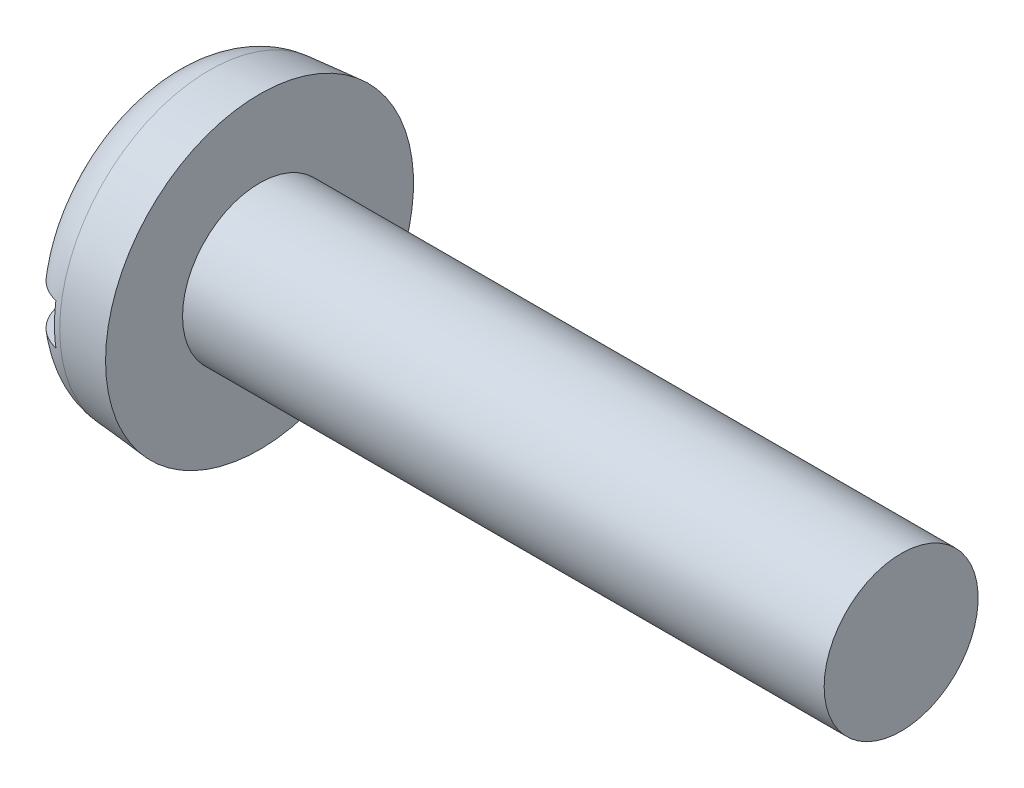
ISO-10303-21;
HEADER;
FILE_DESCRIPTION(('STEP AP214'),'2;1');
FILE_NAME('part.step','',(''),(''),'','','');
FILE_SCHEMA(('AUTOMOTIVE_DESIGN { 1 0 10303 214 1 1 1 1 }'));
ENDSEC;
DATA;
#1=APPLICATION_CONTEXT('core data for automotive mechanical design processes');
#2=APPLICATION_PROTOCOL_DEFINITION('international standard','automotive_design',2000,#1);
#3=PRODUCT_CONTEXT('',#1,'mechanical');
#4=PRODUCT('Part','Part','',(#3));
#5=PRODUCT_RELATED_PRODUCT_CATEGORY('part','',(#4));
#6=PRODUCT_DEFINITION_FORMATION('','',#4);
#7=PRODUCT_DEFINITION_CONTEXT('part definition',#1,'design');
#8=PRODUCT_DEFINITION('design','',#6,#7);
#9=PRODUCT_DEFINITION_SHAPE('','',#8);
#10=(LENGTH_UNIT() NAMED_UNIT(*) SI_UNIT(.MILLI.,.METRE.));
#11=(NAMED_UNIT(*) PLANE_ANGLE_UNIT() SI_UNIT($,.RADIAN.));
#12=(NAMED_UNIT(*) SI_UNIT($,.STERADIAN.) SOLID_ANGLE_UNIT());
#13=UNCERTAINTY_MEASURE_WITH_UNIT(LENGTH_MEASURE(1.E-05),#10,'distance_accuracy_value','');
#14=(GEOMETRIC_REPRESENTATION_CONTEXT(3) GLOBAL_UNCERTAINTY_ASSIGNED_CONTEXT((#13)) GLOBAL_UNIT_ASSIGNED_CONTEXT((#10,
#11,#12)) REPRESENTATION_CONTEXT('',''));
#15=CARTESIAN_POINT('',(0.,0.,0.));
#16=DIRECTION('',(0.,0.,1.));
#17=DIRECTION('',(1.,0.,0.));
#18=AXIS2_PLACEMENT_3D('',#15,#16,#17);
#19=CARTESIAN_POINT('',(0.,0.,0.));
#20=DIRECTION('',(-1.,0.,0.));
#21=DIRECTION('',(0.,0.,1.));
#22=AXIS2_PLACEMENT_3D('',#19,#20,#21);
#23=PLANE('',#22);
#24=DIRECTION('',(0.,0.,-1.));
#25=VECTOR('',#24,1.);
#26=CARTESIAN_POINT('',(0.,0.799999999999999,6.));
#27=LINE('',#26,#25);
#28=CARTESIAN_POINT('',(0.,0.799999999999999,3.9555566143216));
#29=VERTEX_POINT('',#28);
#30=CARTESIAN_POINT('',(0.,0.799999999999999,-3.9555566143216));
#31=VERTEX_POINT('',#30);
#32=EDGE_CURVE('E85',#29,#31,#27,.T.);
#33=ORIENTED_EDGE('',*,*,#32,.F.);
#34=CARTESIAN_POINT('',(0.,0.,0.));
#35=DIRECTION('',(-1.,0.,0.));
#36=DIRECTION('',(0.,0.,1.));
#37=AXIS2_PLACEMENT_3D('',#34,#35,#36);
#38=CIRCLE('',#37,4.03564469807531);
#39=EDGE_CURVE('E91',#29,#31,#38,.T.);
#40=ORIENTED_EDGE('',*,*,#39,.T.);
#41=EDGE_LOOP('',(#33,#40));
#42=FACE_BOUND('',#41,.T.);
#43=ADVANCED_FACE('F32',(#42),#23,.T.);
#44=CARTESIAN_POINT('',(-25.4,0.,0.));
#45=DIRECTION('',(-1.,0.,0.));
#46=DIRECTION('',(0.,0.,1.));
#47=AXIS2_PLACEMENT_3D('',#44,#45,#46);
#48=CYLINDRICAL_SURFACE('',#47,3.);
#49=CARTESIAN_POINT('',(28.6,0.,0.));
#50=DIRECTION('',(-1.,0.,0.));
#51=DIRECTION('',(0.,0.,1.));
#52=AXIS2_PLACEMENT_3D('',#49,#50,#51);
#53=CIRCLE('',#52,3.);
#54=CARTESIAN_POINT('',(28.6,0.,3.));
#55=VERTEX_POINT('',#54);
#56=EDGE_CURVE('E92',#55,#55,#53,.T.);
#57=ORIENTED_EDGE('',*,*,#56,.T.);
#58=EDGE_LOOP('',(#57));
#59=FACE_BOUND('',#58,.T.);
#60=CARTESIAN_POINT('',(3.6,0.,0.));
#61=DIRECTION('',(-1.,0.,0.));
#62=DIRECTION('',(0.,0.,1.));
#63=AXIS2_PLACEMENT_3D('',#60,#61,#62);
#64=CIRCLE('',#63,3.);
#65=CARTESIAN_POINT('',(3.6,0.,3.));
#66=VERTEX_POINT('',#65);
#67=EDGE_CURVE('E149',#66,#66,#64,.T.);
#68=ORIENTED_EDGE('',*,*,#67,.F.);
#69=EDGE_LOOP('',(#68));
#70=FACE_BOUND('',#69,.T.);
#71=ADVANCED_FACE('F137',(#59,#70),#48,.T.);
#72=CARTESIAN_POINT('',(28.6,3.,0.));
#73=DIRECTION('',(1.,0.,0.));
#74=DIRECTION('',(0.,0.,-1.));
#75=AXIS2_PLACEMENT_3D('',#72,#73,#74);
#76=PLANE('',#75);
#77=ORIENTED_EDGE('',*,*,#56,.F.);
#78=EDGE_LOOP('',(#77));
#79=FACE_BOUND('',#78,.T.);
#80=ADVANCED_FACE('F135',(#79),#76,.T.);
#81=DIRECTION('',(0.,0.,1.));
#82=VECTOR('',#81,1.);
#83=CARTESIAN_POINT('',(0.,-0.799999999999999,-6.));
#84=LINE('',#83,#82);
#85=CARTESIAN_POINT('',(0.,-0.799999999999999,-3.9555566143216));
#86=VERTEX_POINT('',#85);
#87=CARTESIAN_POINT('',(0.,-0.800000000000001,3.9555566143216));
#88=VERTEX_POINT('',#87);
#89=EDGE_CURVE('E76',#86,#88,#84,.T.);
#90=ORIENTED_EDGE('',*,*,#89,.F.);
#91=EDGE_CURVE('E83',#86,#88,#38,.T.);
#92=ORIENTED_EDGE('',*,*,#91,.T.);
#93=EDGE_LOOP('',(#90,#92));
#94=FACE_BOUND('',#93,.T.);
#95=ADVANCED_FACE('F82',(#94),#23,.T.);
#96=CARTESIAN_POINT('',(0.,0.,0.));
#97=DIRECTION('',(1.,0.,0.));
#98=DIRECTION('',(0.,0.,-1.));
#99=AXIS2_PLACEMENT_3D('',#96,#97,#98);
#100=CONICAL_SURFACE('',#99,5.68504081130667,0.0872664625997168);
#101=CARTESIAN_POINT('',(1.64311966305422,0.,0.));
#102=DIRECTION('',(-1.,0.,0.));
#103=DIRECTION('',(0.,0.,1.));
#104=AXIS2_PLACEMENT_3D('',#101,#102,#103);
#105=CIRCLE('',#104,5.82879515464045);
#106=CARTESIAN_POINT('',(1.64311966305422,0.,5.82879515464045));
#107=VERTEX_POINT('',#106);
#108=EDGE_CURVE('E95',#107,#107,#105,.F.);
#109=ORIENTED_EDGE('',*,*,#108,.T.);
#110=EDGE_LOOP('',(#109));
#111=FACE_BOUND('',#110,.T.);
#112=CARTESIAN_POINT('',(3.6,0.,0.));
#113=DIRECTION('',(-1.,0.,0.));
#114=DIRECTION('',(0.,0.,1.));
#115=AXIS2_PLACEMENT_3D('',#112,#113,#114);
#116=CIRCLE('',#115,6.);
#117=CARTESIAN_POINT('',(3.6,0.,6.));
#118=VERTEX_POINT('',#117);
#119=EDGE_CURVE('E97',#118,#118,#116,.T.);
#120=ORIENTED_EDGE('',*,*,#119,.T.);
#121=EDGE_LOOP('',(#120));
#122=FACE_BOUND('',#121,.T.);
#123=ADVANCED_FACE('F128',(#111,#122),#100,.T.);
#124=CARTESIAN_POINT('',(3.6,3.,0.));
#125=DIRECTION('',(-1.,0.,0.));
#126=DIRECTION('',(0.,0.,1.));
#127=AXIS2_PLACEMENT_3D('',#124,#125,#126);
#128=PLANE('',#127);
#129=ORIENTED_EDGE('',*,*,#119,.F.);
#130=EDGE_LOOP('',(#129));
#131=FACE_BOUND('',#130,.T.);
#132=ORIENTED_EDGE('',*,*,#67,.T.);
#133=EDGE_LOOP('',(#132));
#134=FACE_BOUND('',#133,.T.);
#135=ADVANCED_FACE('F124',(#131,#134),#128,.F.);
#136=CARTESIAN_POINT('',(1.8,0.,0.));
#137=DIRECTION('',(-1.,0.,0.));
#138=DIRECTION('',(0.,0.,1.));
#139=AXIS2_PLACEMENT_3D('',#136,#137,#138);
#140=TOROIDAL_SURFACE('',#139,4.03564469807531,1.8);
#141=CARTESIAN_POINT('',(0.540762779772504,0.799999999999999,-5.2613759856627));
#142=CARTESIAN_POINT('',(0.612348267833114,0.799999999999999,-5.33226007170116));
#143=CARTESIAN_POINT('',(0.689931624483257,0.799999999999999,-5.3971854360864));
#144=CARTESIAN_POINT('',(0.854947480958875,0.799999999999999,-5.51316161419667));
#145=CARTESIAN_POINT('',(0.94239068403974,0.799999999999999,-5.56419714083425));
#146=CARTESIAN_POINT('',(1.12461220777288,0.799999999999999,-5.650821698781));
#147=CARTESIAN_POINT('',(1.21938917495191,0.799999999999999,-5.6864135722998));
#148=CARTESIAN_POINT('',(1.41356630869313,0.799999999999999,-5.74109194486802));
#149=CARTESIAN_POINT('',(1.51296538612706,0.799999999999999,-5.76018231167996));
#150=CARTESIAN_POINT('',(1.71313899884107,0.799999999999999,-5.78126121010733));
#151=CARTESIAN_POINT('',(1.81390602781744,0.799999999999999,-5.78332104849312));
#152=CARTESIAN_POINT('',(2.01435310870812,0.799999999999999,-5.77046455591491));
#153=CARTESIAN_POINT('',(2.11403314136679,0.799999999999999,-5.75554792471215));
#154=CARTESIAN_POINT('',(2.309314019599,0.799999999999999,-5.70921606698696));
#155=CARTESIAN_POINT('',(2.40492104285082,0.799999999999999,-5.67782686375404));
#156=CARTESIAN_POINT('',(2.58952927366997,0.799999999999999,-5.59948776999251));
#157=CARTESIAN_POINT('',(2.67853045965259,0.799999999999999,-5.55253782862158));
#158=CARTESIAN_POINT('',(2.84769451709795,0.799999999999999,-5.44428887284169));
#159=CARTESIAN_POINT('',(2.92783091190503,0.799999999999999,-5.38294849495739));
#160=CARTESIAN_POINT('',(3.07676159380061,0.799999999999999,-5.24777626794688));
#161=CARTESIAN_POINT('',(3.1455556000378,0.799999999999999,-5.17394410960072));
#162=CARTESIAN_POINT('',(3.27042510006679,0.799999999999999,-5.01531035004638));
#163=CARTESIAN_POINT('',(3.32640120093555,0.799999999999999,-4.93043053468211));
#164=CARTESIAN_POINT('',(3.4235057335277,0.799999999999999,-4.75256933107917));
#165=CARTESIAN_POINT('',(3.46463341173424,0.799999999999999,-4.65958753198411));
#166=CARTESIAN_POINT('',(3.53144158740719,0.799999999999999,-4.46694835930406));
#167=CARTESIAN_POINT('',(3.55692557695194,0.799999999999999,-4.36722286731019));
#168=CARTESIAN_POINT('',(3.59108701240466,0.799999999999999,-4.16493761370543));
#169=CARTESIAN_POINT('',(3.59976314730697,0.799999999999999,-4.06237763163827));
#170=CARTESIAN_POINT('',(3.60023112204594,0.799999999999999,-3.85550711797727));
#171=CARTESIAN_POINT('',(3.59173848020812,0.799999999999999,-3.75119596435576));
#172=CARTESIAN_POINT('',(3.55768438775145,0.799999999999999,-3.54539907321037));
#173=CARTESIAN_POINT('',(3.53212117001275,0.799999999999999,-3.44391362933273));
#174=CARTESIAN_POINT('',(3.46412322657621,0.799999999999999,-3.24471369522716));
#175=CARTESIAN_POINT('',(3.42139292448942,0.799999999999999,-3.14710004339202));
#176=CARTESIAN_POINT('',(3.32030286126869,0.799999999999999,-2.96031799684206));
#177=CARTESIAN_POINT('',(3.26194098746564,0.799999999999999,-2.87115074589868));
#178=CARTESIAN_POINT('',(3.13053846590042,0.799999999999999,-2.70303664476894));
#179=CARTESIAN_POINT('',(3.05736818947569,0.799999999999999,-2.62419095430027));
#180=CARTESIAN_POINT('',(2.89859048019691,0.799999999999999,-2.48017518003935));
#181=CARTESIAN_POINT('',(2.81298317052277,0.799999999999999,-2.41500496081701));
#182=CARTESIAN_POINT('',(2.6334271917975,0.799999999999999,-2.30187272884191));
#183=CARTESIAN_POINT('',(2.53967929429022,0.799999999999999,-2.25359299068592));
#184=CARTESIAN_POINT('',(2.34507363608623,0.799999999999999,-2.17455467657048));
#185=CARTESIAN_POINT('',(2.24421969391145,0.799999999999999,-2.14378676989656));
#186=CARTESIAN_POINT('',(2.04443930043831,0.799999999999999,-2.10254396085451));
#187=CARTESIAN_POINT('',(1.94573097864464,0.799999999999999,-2.09101175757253));
#188=CARTESIAN_POINT('',(1.74783816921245,0.799999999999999,-2.08550669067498));
#189=CARTESIAN_POINT('',(1.64865381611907,0.799999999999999,-2.09152912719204));
#190=CARTESIAN_POINT('',(1.45702700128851,0.799999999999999,-2.12018138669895));
#191=CARTESIAN_POINT('',(1.36447664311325,0.799999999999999,-2.14209986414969));
#192=CARTESIAN_POINT('',(1.18420660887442,0.799999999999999,-2.20075771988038));
#193=CARTESIAN_POINT('',(1.09648771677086,0.799999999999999,-2.23749949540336));
#194=CARTESIAN_POINT('',(0.925723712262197,0.799999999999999,-2.32557805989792));
#195=CARTESIAN_POINT('',(0.842868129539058,0.799999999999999,-2.37728131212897));
#196=CARTESIAN_POINT('',(0.686362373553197,0.799999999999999,-2.493116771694));
#197=CARTESIAN_POINT('',(0.612714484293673,0.799999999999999,-2.55725205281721));
#198=CARTESIAN_POINT('',(0.472161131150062,0.799999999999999,-2.70027682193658));
#199=CARTESIAN_POINT('',(0.405916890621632,0.799999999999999,-2.77981681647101));
#200=CARTESIAN_POINT('',(0.287173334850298,0.799999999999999,-2.9485732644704));
#201=CARTESIAN_POINT('',(0.234676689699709,0.799999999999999,-3.03779159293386));
#202=CARTESIAN_POINT('',(0.143214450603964,0.799999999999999,-3.22677844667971));
#203=CARTESIAN_POINT('',(0.104782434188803,0.799999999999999,-3.32680584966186));
#204=CARTESIAN_POINT('',(0.0452446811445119,0.799999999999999,-3.5318922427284));
#205=CARTESIAN_POINT('',(0.0241387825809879,0.799999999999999,-3.63695118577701));
#206=CARTESIAN_POINT('',(-1.12670491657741E-05,0.799999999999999,-3.84916824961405));
#207=CARTESIAN_POINT('',(-0.00304965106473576,0.799999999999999,-3.95632702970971));
#208=CARTESIAN_POINT('',(0.00921984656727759,0.799999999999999,-4.16962319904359));
#209=CARTESIAN_POINT('',(0.0245310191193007,0.799999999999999,-4.27576040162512));
#210=CARTESIAN_POINT('',(0.0728327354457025,0.799999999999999,-4.48216521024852));
#211=CARTESIAN_POINT('',(0.105541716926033,0.799999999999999,-4.58249883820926));
#212=CARTESIAN_POINT('',(0.187634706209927,0.799999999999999,-4.77599767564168));
#213=CARTESIAN_POINT('',(0.236996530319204,0.799999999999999,-4.86917222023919));
#214=CARTESIAN_POINT('',(0.329466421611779,0.799999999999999,-5.01228034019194));
#215=CARTESIAN_POINT('',(0.367921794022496,0.799999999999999,-5.06527765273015));
#216=CARTESIAN_POINT('',(0.450329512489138,0.799999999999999,-5.16681267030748));
#217=CARTESIAN_POINT('',(0.494281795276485,0.799999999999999,-5.21535042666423));
#218=CARTESIAN_POINT('',(0.540762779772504,0.799999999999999,-5.2613759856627));
#219=B_SPLINE_CURVE_WITH_KNOTS('',3,(#141,#142,#143,#144,#145,#146,#147,#148,#149,#150,#151,
#152,#153,#154,#155,#156,#157,#158,#159,#160,#161,#162,#163,#164,#165,#166,#167,#168,#169,#170,
#171,#172,#173,#174,#175,#176,#177,#178,#179,#180,#181,#182,#183,#184,#185,#186,#187,#188,#189,
#190,#191,#192,#193,#194,#195,#196,#197,#198,#199,#200,#201,#202,#203,#204,#205,#206,#207,#208,
#209,#210,#211,#212,#213,#214,#215,#216,#217,#218),.UNSPECIFIED.,.T.,.F.,(4,2,2,2,2,2,2,2,2,2,2,
2,2,2,2,2,2,2,2,2,2,2,2,2,2,2,2,2,2,2,2,2,2,2,2,2,2,2,4),(0.,0.301990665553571,
0.604312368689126,0.906578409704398,1.20877358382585,1.50970282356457,1.81063738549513,
2.11109795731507,2.41155951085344,2.71289551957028,3.01423898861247,3.31784547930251,
3.6214673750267,3.92882908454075,4.23621476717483,4.54873547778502,4.86128854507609,
5.17947093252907,5.49769634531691,5.81883829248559,6.13997705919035,6.45470120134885,
6.76925749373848,7.06587349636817,7.36241009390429,7.64643650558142,7.93050886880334,
8.22223277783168,8.51402890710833,8.8231740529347,9.13237919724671,9.45232886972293,
9.77227555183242,10.0923243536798,10.4124305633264,10.7275071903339,11.042165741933,
11.2382527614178,11.4343375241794),.UNSPECIFIED.);
#220=CARTESIAN_POINT('',(1.4,0.799999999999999,-5.73510972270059));
#221=VERTEX_POINT('',#220);
#222=EDGE_CURVE('E11',#31,#221,#219,.T.);
#223=ORIENTED_EDGE('',*,*,#222,.F.);
#224=ORIENTED_EDGE('',*,*,#39,.F.);
#225=CARTESIAN_POINT('',(0.836266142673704,0.799999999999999,2.3847675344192));
#226=CARTESIAN_POINT('',(0.917616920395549,0.799999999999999,2.33037611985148));
#227=CARTESIAN_POINT('',(1.00338812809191,0.799999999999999,2.28250940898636));
#228=CARTESIAN_POINT('',(1.18171371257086,0.799999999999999,2.20157945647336));
#229=CARTESIAN_POINT('',(1.27427138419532,0.799999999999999,2.16852346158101));
#230=CARTESIAN_POINT('',(1.46387360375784,0.799999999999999,2.11861651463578));
#231=CARTESIAN_POINT('',(1.56092620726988,0.799999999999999,2.10179593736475));
#232=CARTESIAN_POINT('',(1.75645828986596,0.799999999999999,2.08531619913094));
#233=CARTESIAN_POINT('',(1.85493729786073,0.799999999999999,2.08565149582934));
#234=CARTESIAN_POINT('',(2.04724581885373,0.799999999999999,2.10316628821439));
#235=CARTESIAN_POINT('',(2.1411242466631,0.799999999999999,2.11981673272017));
#236=CARTESIAN_POINT('',(2.32483197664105,0.799999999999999,2.16840533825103));
#237=CARTESIAN_POINT('',(2.41466058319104,0.799999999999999,2.20034611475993));
#238=CARTESIAN_POINT('',(2.58937479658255,0.799999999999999,2.27883470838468));
#239=CARTESIAN_POINT('',(2.67416016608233,0.799999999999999,2.32560484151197));
#240=CARTESIAN_POINT('',(2.83527159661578,0.799999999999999,2.43194790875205));
#241=CARTESIAN_POINT('',(2.91159566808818,0.799999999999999,2.4915238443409));
#242=CARTESIAN_POINT('',(3.05833847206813,0.799999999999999,2.62557742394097));
#243=CARTESIAN_POINT('',(3.12814463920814,0.799999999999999,2.70072607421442));
#244=CARTESIAN_POINT('',(3.25476371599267,0.799999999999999,2.86127427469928));
#245=CARTESIAN_POINT('',(3.31157384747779,0.799999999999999,2.94667601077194));
#246=CARTESIAN_POINT('',(3.41282909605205,0.799999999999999,3.12914373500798));
#247=CARTESIAN_POINT('',(3.4566732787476,0.799999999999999,3.22654397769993));
#248=CARTESIAN_POINT('',(3.52749042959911,0.799999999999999,3.42730182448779));
#249=CARTESIAN_POINT('',(3.55446245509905,0.799999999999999,3.53065976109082));
#250=CARTESIAN_POINT('',(3.59074777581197,0.799999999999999,3.74099682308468));
#251=CARTESIAN_POINT('',(3.59996828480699,0.799999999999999,3.84799201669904));
#252=CARTESIAN_POINT('',(3.60003154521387,0.799999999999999,4.06199242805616));
#253=CARTESIAN_POINT('',(3.59087543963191,0.799999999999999,4.16899764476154));
#254=CARTESIAN_POINT('',(3.5545508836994,0.799999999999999,4.37828946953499));
#255=CARTESIAN_POINT('',(3.5276490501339,0.799999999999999,4.48062230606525));
#256=CARTESIAN_POINT('',(3.45672417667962,0.799999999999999,4.67917518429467));
#257=CARTESIAN_POINT('',(3.41270279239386,0.799999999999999,4.77539581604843));
#258=CARTESIAN_POINT('',(3.30967441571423,0.799999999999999,4.95711293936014));
#259=CARTESIAN_POINT('',(3.2509575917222,0.799999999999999,5.04277397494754));
#260=CARTESIAN_POINT('',(3.11977209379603,0.799999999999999,5.20282644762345));
#261=CARTESIAN_POINT('',(3.04730458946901,0.799999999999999,5.27721884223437));
#262=CARTESIAN_POINT('',(2.89186263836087,0.799999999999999,5.41145672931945));
#263=CARTESIAN_POINT('',(2.80906226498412,0.799999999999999,5.47150384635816));
#264=CARTESIAN_POINT('',(2.63447307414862,0.799999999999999,5.57667826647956));
#265=CARTESIAN_POINT('',(2.54268479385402,0.799999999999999,5.62180646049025));
#266=CARTESIAN_POINT('',(2.35372245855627,0.799999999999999,5.69541178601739));
#267=CARTESIAN_POINT('',(2.25661170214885,0.799999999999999,5.72405148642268));
#268=CARTESIAN_POINT('',(2.05894963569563,0.799999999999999,5.76452632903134));
#269=CARTESIAN_POINT('',(1.95839844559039,0.799999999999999,5.77636205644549));
#270=CARTESIAN_POINT('',(1.75726466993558,0.799999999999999,5.78286013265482));
#271=CARTESIAN_POINT('',(1.65668492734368,0.799999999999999,5.77761084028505));
#272=CARTESIAN_POINT('',(1.45783846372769,0.799999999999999,5.75028865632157));
#273=CARTESIAN_POINT('',(1.35957171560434,0.799999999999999,5.72821596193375));
#274=CARTESIAN_POINT('',(1.16819371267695,0.799999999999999,5.66791633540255));
#275=CARTESIAN_POINT('',(1.07507939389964,0.799999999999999,5.62969912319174));
#276=CARTESIAN_POINT('',(0.896555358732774,0.799999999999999,5.53823241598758));
#277=CARTESIAN_POINT('',(0.811145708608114,0.799999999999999,5.4849827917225));
#278=CARTESIAN_POINT('',(0.650082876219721,0.799999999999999,5.36476593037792));
#279=CARTESIAN_POINT('',(0.574468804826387,0.799999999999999,5.29774630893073));
#280=CARTESIAN_POINT('',(0.435451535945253,0.799999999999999,5.15205983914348));
#281=CARTESIAN_POINT('',(0.372048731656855,0.799999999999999,5.07339261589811));
#282=CARTESIAN_POINT('',(0.258650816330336,0.799999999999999,4.90594446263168));
#283=CARTESIAN_POINT('',(0.208774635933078,0.799999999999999,4.81708301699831));
#284=CARTESIAN_POINT('',(0.124428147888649,0.799999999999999,4.63233098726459));
#285=CARTESIAN_POINT('',(0.0899587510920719,0.799999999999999,4.53643998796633));
#286=CARTESIAN_POINT('',(0.0368868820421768,0.799999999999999,4.33899079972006));
#287=CARTESIAN_POINT('',(0.0185025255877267,0.799999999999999,4.23737401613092));
#288=CARTESIAN_POINT('',(-0.00125734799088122,0.799999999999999,4.03250747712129));
#289=CARTESIAN_POINT('',(-0.00263209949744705,0.799999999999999,3.9292576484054));
#290=CARTESIAN_POINT('',(0.0116307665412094,0.799999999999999,3.72214563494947));
#291=CARTESIAN_POINT('',(0.0275632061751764,0.799999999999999,3.61830377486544));
#292=CARTESIAN_POINT('',(0.0763335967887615,0.799999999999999,3.41464106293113));
#293=CARTESIAN_POINT('',(0.10917724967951,0.799999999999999,3.31482157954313));
#294=CARTESIAN_POINT('',(0.191511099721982,0.799999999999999,3.12021092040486));
#295=CARTESIAN_POINT('',(0.241286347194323,0.799999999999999,3.02554040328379));
#296=CARTESIAN_POINT('',(0.355915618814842,0.799999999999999,2.8458978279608));
#297=CARTESIAN_POINT('',(0.420755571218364,0.799999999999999,2.76091682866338));
#298=CARTESIAN_POINT('',(0.543269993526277,0.799999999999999,2.62572980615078));
#299=CARTESIAN_POINT('',(0.597683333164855,0.799999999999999,2.57253239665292));
#300=CARTESIAN_POINT('',(0.712598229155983,0.799999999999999,2.4731680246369));
#301=CARTESIAN_POINT('',(0.773099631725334,0.799999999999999,2.42700088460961));
#302=CARTESIAN_POINT('',(0.836266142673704,0.799999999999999,2.3847675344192));
#303=B_SPLINE_CURVE_WITH_KNOTS('',3,(#225,#226,#227,#228,#229,#230,#231,#232,#233,#234,#235,
#236,#237,#238,#239,#240,#241,#242,#243,#244,#245,#246,#247,#248,#249,#250,#251,#252,#253,#254,
#255,#256,#257,#258,#259,#260,#261,#262,#263,#264,#265,#266,#267,#268,#269,#270,#271,#272,#273,
#274,#275,#276,#277,#278,#279,#280,#281,#282,#283,#284,#285,#286,#287,#288,#289,#290,#291,#292,
#293,#294,#295,#296,#297,#298,#299,#300,#301,#302),.UNSPECIFIED.,.T.,.F.,(4,2,2,2,2,2,2,2,2,2,2,
2,2,2,2,2,2,2,2,2,2,2,2,2,2,2,2,2,2,2,2,2,2,2,2,2,2,2,4),(0.,0.293321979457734,
0.586787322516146,0.880800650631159,1.17471899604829,1.45941156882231,1.74415285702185,
2.03338255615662,2.32268012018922,2.62901646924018,2.93541824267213,3.25435495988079,
3.57330949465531,3.89392670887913,4.21452398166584,4.53041098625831,4.84626744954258,
5.1563211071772,5.46634840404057,5.77172128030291,6.0770759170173,6.37936593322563,
6.6816454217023,6.98236409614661,7.2830792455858,7.5836136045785,7.88415054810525,
8.18585270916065,8.48756458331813,8.79184901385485,9.09615143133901,9.40451898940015,
9.71290042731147,10.0266186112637,10.3404426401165,10.6598354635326,10.9789311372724,
11.2066928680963,11.43444884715),.UNSPECIFIED.);
#304=CARTESIAN_POINT('',(1.4,0.799999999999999,5.73510972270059));
#305=VERTEX_POINT('',#304);
#306=EDGE_CURVE('E109',#305,#29,#303,.T.);
#307=ORIENTED_EDGE('',*,*,#306,.F.);
#308=CARTESIAN_POINT('',(1.4,0.,0.));
#309=DIRECTION('',(-1.,0.,0.));
#310=DIRECTION('',(0.,0.,1.));
#311=AXIS2_PLACEMENT_3D('',#308,#309,#310);
#312=CIRCLE('',#311,5.79063757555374);
#313=CARTESIAN_POINT('',(1.4,-0.800000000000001,5.73510972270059));
#314=VERTEX_POINT('',#313);
#315=EDGE_CURVE('E103',#305,#314,#312,.F.);
#316=ORIENTED_EDGE('',*,*,#315,.T.);
#317=CARTESIAN_POINT('',(0.836266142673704,-0.8,2.3847675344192));
#318=CARTESIAN_POINT('',(0.748506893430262,-0.8,2.44345191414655));
#319=CARTESIAN_POINT('',(0.665766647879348,-0.8,2.50981960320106));
#320=CARTESIAN_POINT('',(0.512551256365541,-0.8,2.65561376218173));
#321=CARTESIAN_POINT('',(0.442099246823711,-0.8,2.73506432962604));
#322=CARTESIAN_POINT('',(0.315475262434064,-0.8,2.90443495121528));
#323=CARTESIAN_POINT('',(0.259280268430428,-0.8,2.99433778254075));
#324=CARTESIAN_POINT('',(0.162548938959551,-0.8,3.18215299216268));
#325=CARTESIAN_POINT('',(0.122006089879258,-0.8,3.28006201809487));
#326=CARTESIAN_POINT('',(0.0572425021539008,-0.8,3.4827212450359));
#327=CARTESIAN_POINT('',(0.0332676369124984,-0.8,3.58755021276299));
#328=CARTESIAN_POINT('',(0.00342578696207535,-0.8,3.79976969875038));
#329=CARTESIAN_POINT('',(-0.00244009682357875,-0.800000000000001,3.90716037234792));
#330=CARTESIAN_POINT('',(0.00425089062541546,-0.800000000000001,4.12040369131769));
#331=CARTESIAN_POINT('',(0.0166422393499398,-0.800000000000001,4.22626147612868));
#332=CARTESIAN_POINT('',(0.0593599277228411,-0.800000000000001,4.43429705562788));
#333=CARTESIAN_POINT('',(0.0896844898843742,-0.800000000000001,4.53647521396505));
#334=CARTESIAN_POINT('',(0.166811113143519,-0.800000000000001,4.73226366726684));
#335=CARTESIAN_POINT('',(0.21330327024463,-0.800000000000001,4.82599604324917));
#336=CARTESIAN_POINT('',(0.32162267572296,-0.800000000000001,5.00413844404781));
#337=CARTESIAN_POINT('',(0.383448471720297,-0.800000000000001,5.08854935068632));
#338=CARTESIAN_POINT('',(0.519544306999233,-0.800000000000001,5.24416143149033));
#339=CARTESIAN_POINT('',(0.593588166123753,-0.800000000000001,5.31556046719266));
#340=CARTESIAN_POINT('',(0.752739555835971,-0.800000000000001,5.44472836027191));
#341=CARTESIAN_POINT('',(0.837846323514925,-0.800000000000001,5.5024981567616));
#342=CARTESIAN_POINT('',(1.01558854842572,-0.800000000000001,5.60205300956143));
#343=CARTESIAN_POINT('',(1.10812041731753,-0.800000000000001,5.64402306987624));
#344=CARTESIAN_POINT('',(1.29895009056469,-0.800000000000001,5.71170590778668));
#345=CARTESIAN_POINT('',(1.39724763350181,-0.800000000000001,5.7374194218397));
#346=CARTESIAN_POINT('',(1.59606633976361,-0.800000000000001,5.77169733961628));
#347=CARTESIAN_POINT('',(1.69656671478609,-0.800000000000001,5.78038241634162));
#348=CARTESIAN_POINT('',(1.89759433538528,-0.800000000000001,5.78071120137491));
#349=CARTESIAN_POINT('',(1.99812158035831,-0.800000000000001,5.77235526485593));
#350=CARTESIAN_POINT('',(2.19609344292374,-0.800000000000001,5.73889133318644));
#351=CARTESIAN_POINT('',(2.29354498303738,-0.800000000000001,5.71382425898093));
#352=CARTESIAN_POINT('',(2.48286854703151,-0.800000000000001,5.64771711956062));
#353=CARTESIAN_POINT('',(2.57474056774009,-0.800000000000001,5.60667704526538));
#354=CARTESIAN_POINT('',(2.75051258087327,-0.800000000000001,5.50972539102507));
#355=CARTESIAN_POINT('',(2.8343959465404,-0.800000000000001,5.45378367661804));
#356=CARTESIAN_POINT('',(2.99165678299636,-0.800000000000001,5.32869697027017));
#357=CARTESIAN_POINT('',(3.06503402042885,-0.800000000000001,5.25955168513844));
#358=CARTESIAN_POINT('',(3.19973989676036,-0.800000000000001,5.10955333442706));
#359=CARTESIAN_POINT('',(3.26098586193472,-0.800000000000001,5.02862604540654));
#360=CARTESIAN_POINT('',(3.36919753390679,-0.800000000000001,4.85773374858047));
#361=CARTESIAN_POINT('',(3.41616259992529,-0.800000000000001,4.76776833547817));
#362=CARTESIAN_POINT('',(3.49507738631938,-0.800000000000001,4.5802716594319));
#363=CARTESIAN_POINT('',(3.52685014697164,-0.800000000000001,4.48266594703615));
#364=CARTESIAN_POINT('',(3.57383908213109,-0.800000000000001,4.28355151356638));
#365=CARTESIAN_POINT('',(3.58905405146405,-0.800000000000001,4.18204250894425));
#366=CARTESIAN_POINT('',(3.60277332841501,-0.800000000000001,3.97627512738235));
#367=CARTESIAN_POINT('',(3.60100695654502,-0.8,3.87199872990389));
#368=CARTESIAN_POINT('',(3.58032198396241,-0.8,3.66516328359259));
#369=CARTESIAN_POINT('',(3.56140169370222,-0.8,3.56260440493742));
#370=CARTESIAN_POINT('',(3.50655445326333,-0.8,3.3601262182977));
#371=CARTESIAN_POINT('',(3.47032341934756,-0.8,3.26028924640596));
#372=CARTESIAN_POINT('',(3.38182060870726,-0.8,3.06798854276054));
#373=CARTESIAN_POINT('',(3.32954675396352,-0.8,2.97552576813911));
#374=CARTESIAN_POINT('',(3.20964725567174,-0.8,2.79948120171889));
#375=CARTESIAN_POINT('',(3.14184223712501,-0.8,2.71602141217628));
#376=CARTESIAN_POINT('',(2.99302219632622,-0.8,2.56181483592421));
#377=CARTESIAN_POINT('',(2.91200632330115,-0.8,2.49106886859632));
#378=CARTESIAN_POINT('',(2.73997760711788,-0.8,2.36551639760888));
#379=CARTESIAN_POINT('',(2.64910309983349,-0.8,2.31052086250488));
#380=CARTESIAN_POINT('',(2.4590409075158,-0.8,2.21753014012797));
#381=CARTESIAN_POINT('',(2.35985743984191,-0.8,2.17952638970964));
#382=CARTESIAN_POINT('',(2.16147923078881,-0.8,2.12383562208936));
#383=CARTESIAN_POINT('',(2.06255196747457,-0.8,2.10519696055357));
#384=CARTESIAN_POINT('',(1.86294330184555,-0.8,2.08580594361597));
#385=CARTESIAN_POINT('',(1.76226208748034,-0.8,2.08505168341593));
#386=CARTESIAN_POINT('',(1.56749167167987,-0.8,2.1010369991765));
#387=CARTESIAN_POINT('',(1.47332742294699,-0.8,2.11688981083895));
#388=CARTESIAN_POINT('',(1.28901868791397,-0.8,2.16397488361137));
#389=CARTESIAN_POINT('',(1.19886974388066,-0.8,2.19518960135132));
#390=CARTESIAN_POINT('',(1.0638315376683,-0.8,2.25452352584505));
#391=CARTESIAN_POINT('',(1.01673933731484,-0.8,2.27777851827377));
#392=CARTESIAN_POINT('',(0.924773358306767,-0.8,2.32831196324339));
#393=CARTESIAN_POINT('',(0.879899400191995,-0.8,2.35559008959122));
#394=CARTESIAN_POINT('',(0.836266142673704,-0.8,2.3847675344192));
#395=B_SPLINE_CURVE_WITH_KNOTS('',3,(#317,#318,#319,#320,#321,#322,#323,#324,#325,#326,#327,
#328,#329,#330,#331,#332,#333,#334,#335,#336,#337,#338,#339,#340,#341,#342,#343,#344,#345,#346,
#347,#348,#349,#350,#351,#352,#353,#354,#355,#356,#357,#358,#359,#360,#361,#362,#363,#364,#365,
#366,#367,#368,#369,#370,#371,#372,#373,#374,#375,#376,#377,#378,#379,#380,#381,#382,#383,#384,
#385,#386,#387,#388,#389,#390,#391,#392,#393,#394),.UNSPECIFIED.,.T.,.F.,(4,2,2,2,2,2,2,2,2,2,2,
2,2,2,2,2,2,2,2,2,2,2,2,2,2,2,2,2,2,2,2,2,2,2,2,2,2,2,4),(0.,0.316518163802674,
0.633625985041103,0.950218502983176,1.2666791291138,1.58774070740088,1.90882180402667,
2.22700979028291,2.54516624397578,2.8575328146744,3.16986980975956,3.47696670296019,
3.78404242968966,4.08740155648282,4.39074693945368,4.69193476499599,4.99311631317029,
5.29356304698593,5.59400995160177,5.89506910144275,6.19613493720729,6.49918680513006,
6.80225226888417,7.10876667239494,7.41530338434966,7.72673423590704,8.03819576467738,
8.35534173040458,8.6725287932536,8.99358246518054,9.31465682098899,9.63169865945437,
9.94858054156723,10.2490245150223,10.549436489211,10.8345871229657,11.1194128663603,
11.276796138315,11.4341666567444),.UNSPECIFIED.);
#396=EDGE_CURVE('E90',#88,#314,#395,.T.);
#397=ORIENTED_EDGE('',*,*,#396,.F.);
#398=ORIENTED_EDGE('',*,*,#91,.F.);
#399=CARTESIAN_POINT('',(0.540762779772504,-0.799999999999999,-5.2613759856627));
#400=CARTESIAN_POINT('',(0.46800256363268,-0.799999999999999,-5.18931554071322));
#401=CARTESIAN_POINT('',(0.401331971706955,-0.799999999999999,-5.11098969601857));
#402=CARTESIAN_POINT('',(0.282092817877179,-0.799999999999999,-4.94415021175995));
#403=CARTESIAN_POINT('',(0.229543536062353,-0.799999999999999,-4.85562287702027));
#404=CARTESIAN_POINT('',(0.140058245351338,-0.799999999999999,-4.67111833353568));
#405=CARTESIAN_POINT('',(0.103104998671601,-0.799999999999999,-4.57514948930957));
#406=CARTESIAN_POINT('',(0.0456444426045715,-0.799999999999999,-4.37844736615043));
#407=CARTESIAN_POINT('',(0.0251330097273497,-0.799999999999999,-4.27771528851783));
#408=CARTESIAN_POINT('',(0.000807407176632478,-0.799999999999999,-4.07306902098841));
#409=CARTESIAN_POINT('',(-0.00280970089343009,-0.799999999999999,-3.96913144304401));
#410=CARTESIAN_POINT('',(0.00712688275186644,-0.799999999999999,-3.76207815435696));
#411=CARTESIAN_POINT('',(0.0206829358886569,-0.8,-3.65896255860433));
#412=CARTESIAN_POINT('',(0.0648595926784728,-0.8,-3.45448287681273));
#413=CARTESIAN_POINT('',(0.0957869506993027,-0.8,-3.35318504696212));
#414=CARTESIAN_POINT('',(0.173966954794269,-0.8,-3.15709227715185));
#415=CARTESIAN_POINT('',(0.221221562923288,-0.8,-3.06229812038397));
#416=CARTESIAN_POINT('',(0.331523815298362,-0.8,-2.8805427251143));
#417=CARTESIAN_POINT('',(0.394784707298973,-0.8,-2.79371074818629));
#418=CARTESIAN_POINT('',(0.535080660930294,-0.8,-2.63196239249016));
#419=CARTESIAN_POINT('',(0.612117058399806,-0.8,-2.5570471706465));
#420=CARTESIAN_POINT('',(0.777363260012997,-0.8,-2.42207446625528));
#421=CARTESIAN_POINT('',(0.865488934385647,-0.8,-2.36191424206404));
#422=CARTESIAN_POINT('',(1.05097305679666,-0.8,-2.25807126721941));
#423=CARTESIAN_POINT('',(1.1483280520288,-0.8,-2.21438238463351));
#424=CARTESIAN_POINT('',(1.34472607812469,-0.8,-2.14709500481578));
#425=CARTESIAN_POINT('',(1.44348146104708,-0.8,-2.12265879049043));
#426=CARTESIAN_POINT('',(1.64375523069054,-0.8,-2.09184121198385));
#427=CARTESIAN_POINT('',(1.74527230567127,-0.8,-2.08545142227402));
#428=CARTESIAN_POINT('',(1.94205144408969,-0.8,-2.09089422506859));
#429=CARTESIAN_POINT('',(2.03734311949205,-0.8,-2.1017185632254));
#430=CARTESIAN_POINT('',(2.22475371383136,-0.8,-2.1391955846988));
#431=CARTESIAN_POINT('',(2.31687240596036,-0.8,-2.16584939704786));
#432=CARTESIAN_POINT('',(2.49568716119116,-0.8,-2.23389898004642));
#433=CARTESIAN_POINT('',(2.58237134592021,-0.8,-2.27532580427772));
#434=CARTESIAN_POINT('',(2.74807422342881,-0.8,-2.37138684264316));
#435=CARTESIAN_POINT('',(2.82709115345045,-0.8,-2.42602408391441));
#436=CARTESIAN_POINT('',(2.9799165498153,-0.8,-2.55022645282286));
#437=CARTESIAN_POINT('',(3.05318434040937,-0.8,-2.6204569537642));
#438=CARTESIAN_POINT('',(3.18755425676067,-0.8,-2.77172635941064));
#439=CARTESIAN_POINT('',(3.24865355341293,-0.8,-2.85276777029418));
#440=CARTESIAN_POINT('',(3.35979277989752,-0.8,-3.02754470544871));
#441=CARTESIAN_POINT('',(3.40917690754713,-0.8,-3.1216981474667));
#442=CARTESIAN_POINT('',(3.49164209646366,-0.8,-3.31689856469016));
#443=CARTESIAN_POINT('',(3.52472176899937,-0.8,-3.41794612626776));
#444=CARTESIAN_POINT('',(3.57383047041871,-0.8,-3.62528781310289));
#445=CARTESIAN_POINT('',(3.58966846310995,-0.8,-3.73162733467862));
#446=CARTESIAN_POINT('',(3.60302482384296,-0.8,-3.94545563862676));
#447=CARTESIAN_POINT('',(3.60054405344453,-0.799999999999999,-4.05294436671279));
#448=CARTESIAN_POINT('',(3.57730809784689,-0.799999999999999,-4.26456838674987));
#449=CARTESIAN_POINT('',(3.5567824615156,-0.799999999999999,-4.36872882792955));
#450=CARTESIAN_POINT('',(3.49820144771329,-0.799999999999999,-4.57200098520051));
#451=CARTESIAN_POINT('',(3.46014775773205,-0.799999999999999,-4.67111318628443));
#452=CARTESIAN_POINT('',(3.36835841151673,-0.799999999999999,-4.85952398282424));
#453=CARTESIAN_POINT('',(3.31492535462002,-0.799999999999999,-4.94897001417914));
#454=CARTESIAN_POINT('',(3.19357222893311,-0.799999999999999,-5.1174283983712));
#455=CARTESIAN_POINT('',(3.12565341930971,-0.799999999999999,-5.196441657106));
#456=CARTESIAN_POINT('',(2.97843308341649,-0.799999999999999,-5.34047951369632));
#457=CARTESIAN_POINT('',(2.89932889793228,-0.799999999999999,-5.40570586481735));
#458=CARTESIAN_POINT('',(2.73119091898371,-0.799999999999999,-5.52177624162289));
#459=CARTESIAN_POINT('',(2.64215774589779,-0.799999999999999,-5.57262116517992));
#460=CARTESIAN_POINT('',(2.45774484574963,-0.799999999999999,-5.65792437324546));
#461=CARTESIAN_POINT('',(2.36244515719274,-0.799999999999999,-5.69255575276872));
#462=CARTESIAN_POINT('',(2.16736859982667,-0.799999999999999,-5.7452167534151));
#463=CARTESIAN_POINT('',(2.06759209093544,-0.799999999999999,-5.76324770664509));
#464=CARTESIAN_POINT('',(1.8670464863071,-0.799999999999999,-5.78211504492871));
#465=CARTESIAN_POINT('',(1.76628722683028,-0.799999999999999,-5.78305617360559));
#466=CARTESIAN_POINT('',(1.56601778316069,-0.799999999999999,-5.76798048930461));
#467=CARTESIAN_POINT('',(1.46650790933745,-0.799999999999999,-5.75195954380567));
#468=CARTESIAN_POINT('',(1.27169371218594,-0.799999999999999,-5.70345798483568));
#469=CARTESIAN_POINT('',(1.17638560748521,-0.799999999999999,-5.67099251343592));
#470=CARTESIAN_POINT('',(0.992639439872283,-0.799999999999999,-5.59058259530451));
#471=CARTESIAN_POINT('',(0.904192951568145,-0.799999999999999,-5.54265751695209));
#472=CARTESIAN_POINT('',(0.770167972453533,-0.799999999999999,-5.45480755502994));
#473=CARTESIAN_POINT('',(0.72159797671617,-0.799999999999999,-5.41935523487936));
#474=CARTESIAN_POINT('',(0.628240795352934,-0.799999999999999,-5.34377955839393));
#475=CARTESIAN_POINT('',(0.583453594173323,-0.799999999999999,-5.30365622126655));
#476=CARTESIAN_POINT('',(0.540762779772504,-0.799999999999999,-5.2613759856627));
#477=B_SPLINE_CURVE_WITH_KNOTS('',3,(#399,#400,#401,#402,#403,#404,#405,#406,#407,#408,#409,
#410,#411,#412,#413,#414,#415,#416,#417,#418,#419,#420,#421,#422,#423,#424,#425,#426,#427,#428,
#429,#430,#431,#432,#433,#434,#435,#436,#437,#438,#439,#440,#441,#442,#443,#444,#445,#446,#447,
#448,#449,#450,#451,#452,#453,#454,#455,#456,#457,#458,#459,#460,#461,#462,#463,#464,#465,#466,
#467,#468,#469,#470,#471,#472,#473,#474,#475,#476),.UNSPECIFIED.,.T.,.F.,(4,2,2,2,2,2,2,2,2,2,2,
2,2,2,2,2,2,2,2,2,2,2,2,2,2,2,2,2,2,2,2,2,2,2,2,2,2,2,4),(0.,0.306991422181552,0.61439988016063,
0.921467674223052,1.22845843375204,1.53902124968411,1.84962677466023,2.1658978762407,
2.48220699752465,2.80297521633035,3.12377455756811,3.4422723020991,3.76065135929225,
4.06426589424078,4.36773865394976,4.65408102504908,4.94044382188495,5.22741215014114,
5.51444629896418,5.81757894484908,6.12078198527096,6.43825439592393,6.75575384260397,
7.07673643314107,7.39770392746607,7.71464653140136,8.03155862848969,8.34261788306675,
8.65365010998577,8.95975564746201,9.2658420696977,9.56858170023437,9.87129703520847,
10.1721563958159,10.4730890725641,10.7737451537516,11.0740260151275,11.254148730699,
11.4342707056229),.UNSPECIFIED.);
#478=CARTESIAN_POINT('',(1.4,-0.799999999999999,-5.73510972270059));
#479=VERTEX_POINT('',#478);
#480=EDGE_CURVE('E44',#479,#86,#477,.T.);
#481=ORIENTED_EDGE('',*,*,#480,.F.);
#482=EDGE_CURVE('E56',#479,#221,#312,.F.);
#483=ORIENTED_EDGE('',*,*,#482,.T.);
#484=EDGE_LOOP('',(#223,#224,#307,#316,#397,#398,#481,#483));
#485=FACE_BOUND('',#484,.T.);
#486=ORIENTED_EDGE('',*,*,#108,.F.);
#487=EDGE_LOOP('',(#486));
#488=FACE_BOUND('',#487,.T.);
#489=ADVANCED_FACE('F34',(#485,#488),#140,.T.);
#490=CARTESIAN_POINT('',(1.4,0.799999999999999,6.));
#491=DIRECTION('',(0.,1.,0.));
#492=DIRECTION('',(0.,0.,1.));
#493=AXIS2_PLACEMENT_3D('',#490,#491,#492);
#494=PLANE('',#493);
#495=ORIENTED_EDGE('',*,*,#222,.T.);
#496=DIRECTION('',(0.,0.,-1.));
#497=VECTOR('',#496,1.);
#498=CARTESIAN_POINT('',(1.4,0.799999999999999,6.));
#499=LINE('',#498,#497);
#500=EDGE_CURVE('E84',#305,#221,#499,.T.);
#501=ORIENTED_EDGE('',*,*,#500,.F.);
#502=ORIENTED_EDGE('',*,*,#306,.T.);
#503=ORIENTED_EDGE('',*,*,#32,.T.);
#504=EDGE_LOOP('',(#495,#501,#502,#503));
#505=FACE_BOUND('',#504,.T.);
#506=ADVANCED_FACE('F116',(#505),#494,.F.);
#507=CARTESIAN_POINT('',(1.4,-0.799999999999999,-6.));
#508=DIRECTION('',(0.,-1.,0.));
#509=DIRECTION('',(0.,0.,-1.));
#510=AXIS2_PLACEMENT_3D('',#507,#508,#509);
#511=PLANE('',#510);
#512=ORIENTED_EDGE('',*,*,#480,.T.);
#513=ORIENTED_EDGE('',*,*,#89,.T.);
#514=ORIENTED_EDGE('',*,*,#396,.T.);
#515=DIRECTION('',(0.,0.,1.));
#516=VECTOR('',#515,1.);
#517=CARTESIAN_POINT('',(1.4,-0.799999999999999,-6.));
#518=LINE('',#517,#516);
#519=EDGE_CURVE('E51',#479,#314,#518,.T.);
#520=ORIENTED_EDGE('',*,*,#519,.F.);
#521=EDGE_LOOP('',(#512,#513,#514,#520));
#522=FACE_BOUND('',#521,.T.);
#523=ADVANCED_FACE('F75',(#522),#511,.F.);
#524=CARTESIAN_POINT('',(1.4,0.799999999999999,-6.));
#525=DIRECTION('',(-1.,0.,0.));
#526=DIRECTION('',(0.,0.,1.));
#527=AXIS2_PLACEMENT_3D('',#524,#525,#526);
#528=PLANE('',#527);
#529=ORIENTED_EDGE('',*,*,#519,.T.);
#530=ORIENTED_EDGE('',*,*,#315,.F.);
#531=ORIENTED_EDGE('',*,*,#500,.T.);
#532=ORIENTED_EDGE('',*,*,#482,.F.);
#533=EDGE_LOOP('',(#529,#530,#531,#532));
#534=FACE_BOUND('',#533,.T.);
#535=ADVANCED_FACE('F115',(#534),#528,.T.);
#536=CLOSED_SHELL('',(#43,#71,#80,#95,#123,#135,#489,#506,#523,#535));
#537=MANIFOLD_SOLID_BREP('B2',#536);
#538=ADVANCED_BREP_SHAPE_REPRESENTATION('',(#18,#537),#14);
#539=SHAPE_DEFINITION_REPRESENTATION(#9,#538);
ENDSEC;
END-ISO-10303-21;
